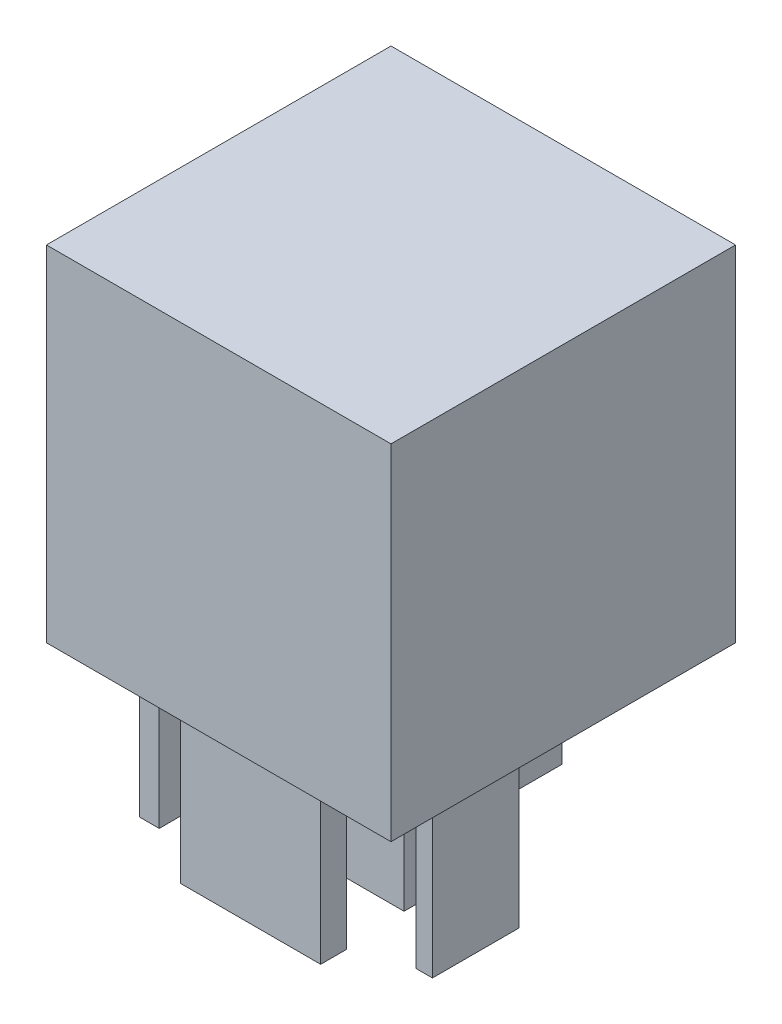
ISO-10303-21;
HEADER;
FILE_DESCRIPTION(('STEP AP214'),'2;1');
FILE_NAME('part.step','',(''),(''),'','','');
FILE_SCHEMA(('AUTOMOTIVE_DESIGN { 1 0 10303 214 1 1 1 1 }'));
ENDSEC;
DATA;
#1=APPLICATION_CONTEXT('core data for automotive mechanical design processes');
#2=APPLICATION_PROTOCOL_DEFINITION('international standard','automotive_design',2000,#1);
#3=PRODUCT_CONTEXT('',#1,'mechanical');
#4=PRODUCT('Part','Part','',(#3));
#5=PRODUCT_RELATED_PRODUCT_CATEGORY('part','',(#4));
#6=PRODUCT_DEFINITION_FORMATION('','',#4);
#7=PRODUCT_DEFINITION_CONTEXT('part definition',#1,'design');
#8=PRODUCT_DEFINITION('design','',#6,#7);
#9=PRODUCT_DEFINITION_SHAPE('','',#8);
#10=(LENGTH_UNIT() NAMED_UNIT(*) SI_UNIT(.MILLI.,.METRE.));
#11=(NAMED_UNIT(*) PLANE_ANGLE_UNIT() SI_UNIT($,.RADIAN.));
#12=(NAMED_UNIT(*) SI_UNIT($,.STERADIAN.) SOLID_ANGLE_UNIT());
#13=UNCERTAINTY_MEASURE_WITH_UNIT(LENGTH_MEASURE(1.E-05),#10,'distance_accuracy_value','');
#14=(GEOMETRIC_REPRESENTATION_CONTEXT(3) GLOBAL_UNCERTAINTY_ASSIGNED_CONTEXT((#13)) GLOBAL_UNIT_ASSIGNED_CONTEXT((#10,
#11,#12)) REPRESENTATION_CONTEXT('',''));
#15=CARTESIAN_POINT('',(0.,0.,0.));
#16=DIRECTION('',(0.,0.,1.));
#17=DIRECTION('',(1.,0.,0.));
#18=AXIS2_PLACEMENT_3D('',#15,#16,#17);
#19=CARTESIAN_POINT('',(-20.,0.,20.));
#20=DIRECTION('',(0.,1.,0.));
#21=DIRECTION('',(0.,0.,1.));
#22=AXIS2_PLACEMENT_3D('',#19,#20,#21);
#23=PLANE('',#22);
#24=DIRECTION('',(0.,0.,-1.));
#25=VECTOR('',#24,1.);
#26=CARTESIAN_POINT('',(14.1829873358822,0.,11.2969143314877));
#27=LINE('',#26,#25);
#28=CARTESIAN_POINT('',(14.1829873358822,0.,11.2969143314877));
#29=VERTEX_POINT('',#28);
#30=CARTESIAN_POINT('',(14.1829873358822,0.,1.23688843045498));
#31=VERTEX_POINT('',#30);
#32=EDGE_CURVE('E214',#29,#31,#27,.T.);
#33=ORIENTED_EDGE('',*,*,#32,.F.);
#34=DIRECTION('',(-1.,0.,0.));
#35=VECTOR('',#34,1.);
#36=CARTESIAN_POINT('',(14.1829873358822,0.,11.2969143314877));
#37=LINE('',#36,#35);
#38=CARTESIAN_POINT('',(16.1070360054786,0.,11.2969143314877));
#39=VERTEX_POINT('',#38);
#40=EDGE_CURVE('E227',#39,#29,#37,.T.);
#41=ORIENTED_EDGE('',*,*,#40,.F.);
#42=DIRECTION('',(0.,0.,1.));
#43=VECTOR('',#42,1.);
#44=CARTESIAN_POINT('',(16.1070360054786,0.,11.2969143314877));
#45=LINE('',#44,#43);
#46=CARTESIAN_POINT('',(16.1070360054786,0.,1.23688843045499));
#47=VERTEX_POINT('',#46);
#48=EDGE_CURVE('E236',#47,#39,#45,.T.);
#49=ORIENTED_EDGE('',*,*,#48,.F.);
#50=DIRECTION('',(1.,0.,0.));
#51=VECTOR('',#50,1.);
#52=CARTESIAN_POINT('',(14.1829873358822,0.,1.23688843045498));
#53=LINE('',#52,#51);
#54=EDGE_CURVE('E217',#31,#47,#53,.T.);
#55=ORIENTED_EDGE('',*,*,#54,.F.);
#56=EDGE_LOOP('',(#33,#41,#49,#55));
#57=FACE_BOUND('',#56,.T.);
#58=DIRECTION('',(0.,0.,-1.));
#59=VECTOR('',#58,1.);
#60=CARTESIAN_POINT('',(-8.24592286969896,0.,6.23941497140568));
#61=LINE('',#60,#59);
#62=CARTESIAN_POINT('',(-8.24592286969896,0.,6.23941497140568));
#63=VERTEX_POINT('',#62);
#64=CARTESIAN_POINT('',(-8.24592286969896,0.,2.61120890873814));
#65=VERTEX_POINT('',#64);
#66=EDGE_CURVE('E285',#63,#65,#61,.T.);
#67=ORIENTED_EDGE('',*,*,#66,.F.);
#68=DIRECTION('',(-1.,0.,0.));
#69=VECTOR('',#68,1.);
#70=CARTESIAN_POINT('',(-8.24592286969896,0.,6.23941497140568));
#71=LINE('',#70,#69);
#72=CARTESIAN_POINT('',(7.75116749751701,0.,6.23941497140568));
#73=VERTEX_POINT('',#72);
#74=EDGE_CURVE('E290',#73,#63,#71,.T.);
#75=ORIENTED_EDGE('',*,*,#74,.F.);
#76=DIRECTION('',(0.,0.,1.));
#77=VECTOR('',#76,1.);
#78=CARTESIAN_POINT('',(7.75116749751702,0.,6.23941497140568));
#79=LINE('',#78,#77);
#80=CARTESIAN_POINT('',(7.75116749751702,0.,2.61120890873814));
#81=VERTEX_POINT('',#80);
#82=EDGE_CURVE('E302',#81,#73,#79,.T.);
#83=ORIENTED_EDGE('',*,*,#82,.F.);
#84=DIRECTION('',(1.,0.,0.));
#85=VECTOR('',#84,1.);
#86=CARTESIAN_POINT('',(-8.24592286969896,0.,2.61120890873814));
#87=LINE('',#86,#85);
#88=EDGE_CURVE('E299',#65,#81,#87,.T.);
#89=ORIENTED_EDGE('',*,*,#88,.F.);
#90=EDGE_LOOP('',(#67,#75,#83,#89));
#91=FACE_BOUND('',#90,.T.);
#92=DIRECTION('',(1.,0.,0.));
#93=VECTOR('',#92,1.);
#94=CARTESIAN_POINT('',(-20.,0.,-20.));
#95=LINE('',#94,#93);
#96=CARTESIAN_POINT('',(-20.,0.,-20.));
#97=VERTEX_POINT('',#96);
#98=CARTESIAN_POINT('',(20.,0.,-20.));
#99=VERTEX_POINT('',#98);
#100=EDGE_CURVE('E365',#97,#99,#95,.T.);
#101=ORIENTED_EDGE('',*,*,#100,.T.);
#102=DIRECTION('',(0.,0.,-1.));
#103=VECTOR('',#102,1.);
#104=CARTESIAN_POINT('',(20.,0.,20.));
#105=LINE('',#104,#103);
#106=CARTESIAN_POINT('',(20.,0.,20.));
#107=VERTEX_POINT('',#106);
#108=EDGE_CURVE('E40',#107,#99,#105,.T.);
#109=ORIENTED_EDGE('',*,*,#108,.F.);
#110=DIRECTION('',(1.,0.,0.));
#111=VECTOR('',#110,1.);
#112=CARTESIAN_POINT('',(-20.,0.,20.));
#113=LINE('',#112,#111);
#114=CARTESIAN_POINT('',(-20.,0.,20.));
#115=VERTEX_POINT('',#114);
#116=EDGE_CURVE('E355',#115,#107,#113,.T.);
#117=ORIENTED_EDGE('',*,*,#116,.F.);
#118=DIRECTION('',(0.,0.,-1.));
#119=VECTOR('',#118,1.);
#120=CARTESIAN_POINT('',(-20.,0.,20.));
#121=LINE('',#120,#119);
#122=EDGE_CURVE('E11',#115,#97,#121,.T.);
#123=ORIENTED_EDGE('',*,*,#122,.T.);
#124=EDGE_LOOP('',(#101,#109,#117,#123));
#125=FACE_BOUND('',#124,.T.);
#126=DIRECTION('',(0.,0.,-1.));
#127=VECTOR('',#126,1.);
#128=CARTESIAN_POINT('',(-8.02603159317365,0.,16.4093865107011));
#129=LINE('',#128,#127);
#130=CARTESIAN_POINT('',(-8.02603159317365,0.,16.4093865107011));
#131=VERTEX_POINT('',#130);
#132=CARTESIAN_POINT('',(-8.02603159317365,0.,13.4408542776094));
#133=VERTEX_POINT('',#132);
#134=EDGE_CURVE('E318',#131,#133,#129,.T.);
#135=ORIENTED_EDGE('',*,*,#134,.F.);
#136=DIRECTION('',(-1.,0.,0.));
#137=VECTOR('',#136,1.);
#138=CARTESIAN_POINT('',(-8.02603159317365,0.,16.4093865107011));
#139=LINE('',#138,#137);
#140=CARTESIAN_POINT('',(8.24592286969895,0.,16.4093865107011));
#141=VERTEX_POINT('',#140);
#142=EDGE_CURVE('E323',#141,#131,#139,.T.);
#143=ORIENTED_EDGE('',*,*,#142,.F.);
#144=DIRECTION('',(0.,0.,1.));
#145=VECTOR('',#144,1.);
#146=CARTESIAN_POINT('',(8.24592286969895,0.,16.4093865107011));
#147=LINE('',#146,#145);
#148=CARTESIAN_POINT('',(8.24592286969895,0.,13.4408542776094));
#149=VERTEX_POINT('',#148);
#150=EDGE_CURVE('E335',#149,#141,#147,.T.);
#151=ORIENTED_EDGE('',*,*,#150,.F.);
#152=DIRECTION('',(1.,0.,0.));
#153=VECTOR('',#152,1.);
#154=CARTESIAN_POINT('',(-8.02603159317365,0.,13.4408542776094));
#155=LINE('',#154,#153);
#156=EDGE_CURVE('E332',#133,#149,#155,.T.);
#157=ORIENTED_EDGE('',*,*,#156,.F.);
#158=EDGE_LOOP('',(#135,#143,#151,#157));
#159=FACE_BOUND('',#158,.T.);
#160=DIRECTION('',(0.,0.,-1.));
#161=VECTOR('',#160,1.);
#162=CARTESIAN_POINT('',(-1.6491845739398,0.,-3.38082837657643));
#163=LINE('',#162,#161);
#164=CARTESIAN_POINT('',(-1.6491845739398,0.,-3.38082837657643));
#165=VERTEX_POINT('',#164);
#166=CARTESIAN_POINT('',(-1.64918457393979,0.,-17.7287341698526));
#167=VERTEX_POINT('',#166);
#168=EDGE_CURVE('E252',#165,#167,#163,.T.);
#169=ORIENTED_EDGE('',*,*,#168,.F.);
#170=DIRECTION('',(-1.,0.,0.));
#171=VECTOR('',#170,1.);
#172=CARTESIAN_POINT('',(-1.6491845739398,0.,-3.38082837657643));
#173=LINE('',#172,#171);
#174=CARTESIAN_POINT('',(2.14393994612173,0.,-3.38082837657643));
#175=VERTEX_POINT('',#174);
#176=EDGE_CURVE('E257',#175,#165,#173,.T.);
#177=ORIENTED_EDGE('',*,*,#176,.F.);
#178=DIRECTION('',(0.,0.,1.));
#179=VECTOR('',#178,1.);
#180=CARTESIAN_POINT('',(2.14393994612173,0.,-3.38082837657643));
#181=LINE('',#180,#179);
#182=CARTESIAN_POINT('',(2.14393994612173,0.,-17.7287341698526));
#183=VERTEX_POINT('',#182);
#184=EDGE_CURVE('E269',#183,#175,#181,.T.);
#185=ORIENTED_EDGE('',*,*,#184,.F.);
#186=DIRECTION('',(1.,0.,0.));
#187=VECTOR('',#186,1.);
#188=CARTESIAN_POINT('',(-1.64918457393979,0.,-17.7287341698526));
#189=LINE('',#188,#187);
#190=EDGE_CURVE('E266',#167,#183,#189,.T.);
#191=ORIENTED_EDGE('',*,*,#190,.F.);
#192=EDGE_LOOP('',(#169,#177,#185,#191));
#193=FACE_BOUND('',#192,.T.);
#194=DIRECTION('',(0.,0.,-1.));
#195=VECTOR('',#194,1.);
#196=CARTESIAN_POINT('',(-17.0965467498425,0.,12.1215066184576));
#197=LINE('',#196,#195);
#198=CARTESIAN_POINT('',(-17.0965467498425,0.,12.1215066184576));
#199=VERTEX_POINT('',#198);
#200=CARTESIAN_POINT('',(-17.0965467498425,0.,0.68716023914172));
#201=VERTEX_POINT('',#200);
#202=EDGE_CURVE('E213',#199,#201,#197,.T.);
#203=ORIENTED_EDGE('',*,*,#202,.F.);
#204=DIRECTION('',(-1.,0.,0.));
#205=VECTOR('',#204,1.);
#206=CARTESIAN_POINT('',(-17.0965467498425,0.,12.1215066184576));
#207=LINE('',#206,#205);
#208=CARTESIAN_POINT('',(-14.7876883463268,0.,12.1215066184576));
#209=VERTEX_POINT('',#208);
#210=EDGE_CURVE('E210',#209,#199,#207,.T.);
#211=ORIENTED_EDGE('',*,*,#210,.F.);
#212=DIRECTION('',(0.,0.,1.));
#213=VECTOR('',#212,1.);
#214=CARTESIAN_POINT('',(-14.7876883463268,0.,12.1215066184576));
#215=LINE('',#214,#213);
#216=CARTESIAN_POINT('',(-14.7876883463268,0.,0.687160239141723));
#217=VERTEX_POINT('',#216);
#218=EDGE_CURVE('E52',#217,#209,#215,.T.);
#219=ORIENTED_EDGE('',*,*,#218,.F.);
#220=DIRECTION('',(1.,0.,0.));
#221=VECTOR('',#220,1.);
#222=CARTESIAN_POINT('',(-17.0965467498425,0.,0.68716023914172));
#223=LINE('',#222,#221);
#224=EDGE_CURVE('E47',#201,#217,#223,.T.);
#225=ORIENTED_EDGE('',*,*,#224,.F.);
#226=EDGE_LOOP('',(#203,#211,#219,#225));
#227=FACE_BOUND('',#226,.T.);
#228=ADVANCED_FACE('F32',(#57,#91,#125,#159,#193,#227),#23,.F.);
#229=CARTESIAN_POINT('',(-20.,0.,20.));
#230=DIRECTION('',(1.,0.,0.));
#231=DIRECTION('',(0.,0.,-1.));
#232=AXIS2_PLACEMENT_3D('',#229,#230,#231);
#233=PLANE('',#232);
#234=DIRECTION('',(0.,-1.,0.));
#235=VECTOR('',#234,1.);
#236=CARTESIAN_POINT('',(-20.,0.,-20.));
#237=LINE('',#236,#235);
#238=CARTESIAN_POINT('',(-20.,40.,-20.));
#239=VERTEX_POINT('',#238);
#240=EDGE_CURVE('E351',#239,#97,#237,.T.);
#241=ORIENTED_EDGE('',*,*,#240,.T.);
#242=ORIENTED_EDGE('',*,*,#122,.F.);
#243=DIRECTION('',(0.,-1.,0.));
#244=VECTOR('',#243,1.);
#245=CARTESIAN_POINT('',(-20.,0.,20.));
#246=LINE('',#245,#244);
#247=CARTESIAN_POINT('',(-20.,40.,20.));
#248=VERTEX_POINT('',#247);
#249=EDGE_CURVE('E352',#248,#115,#246,.T.);
#250=ORIENTED_EDGE('',*,*,#249,.F.);
#251=DIRECTION('',(0.,0.,-1.));
#252=VECTOR('',#251,1.);
#253=CARTESIAN_POINT('',(-20.,40.,20.));
#254=LINE('',#253,#252);
#255=EDGE_CURVE('E362',#248,#239,#254,.T.);
#256=ORIENTED_EDGE('',*,*,#255,.T.);
#257=EDGE_LOOP('',(#241,#242,#250,#256));
#258=FACE_BOUND('',#257,.T.);
#259=ADVANCED_FACE('F34',(#258),#233,.F.);
#260=CARTESIAN_POINT('',(20.,0.,20.));
#261=DIRECTION('',(-1.,0.,0.));
#262=DIRECTION('',(0.,0.,1.));
#263=AXIS2_PLACEMENT_3D('',#260,#261,#262);
#264=PLANE('',#263);
#265=DIRECTION('',(0.,1.,0.));
#266=VECTOR('',#265,1.);
#267=CARTESIAN_POINT('',(20.,0.,-20.));
#268=LINE('',#267,#266);
#269=CARTESIAN_POINT('',(20.,40.,-20.));
#270=VERTEX_POINT('',#269);
#271=EDGE_CURVE('E367',#99,#270,#268,.T.);
#272=ORIENTED_EDGE('',*,*,#271,.T.);
#273=DIRECTION('',(0.,0.,-1.));
#274=VECTOR('',#273,1.);
#275=CARTESIAN_POINT('',(20.,40.,20.));
#276=LINE('',#275,#274);
#277=CARTESIAN_POINT('',(20.,40.,20.));
#278=VERTEX_POINT('',#277);
#279=EDGE_CURVE('E372',#278,#270,#276,.T.);
#280=ORIENTED_EDGE('',*,*,#279,.F.);
#281=DIRECTION('',(0.,1.,0.));
#282=VECTOR('',#281,1.);
#283=CARTESIAN_POINT('',(20.,0.,20.));
#284=LINE('',#283,#282);
#285=EDGE_CURVE('E358',#107,#278,#284,.T.);
#286=ORIENTED_EDGE('',*,*,#285,.F.);
#287=ORIENTED_EDGE('',*,*,#108,.T.);
#288=EDGE_LOOP('',(#272,#280,#286,#287));
#289=FACE_BOUND('',#288,.T.);
#290=ADVANCED_FACE('F379',(#289),#264,.F.);
#291=CARTESIAN_POINT('',(-20.,40.,20.));
#292=DIRECTION('',(0.,-1.,0.));
#293=DIRECTION('',(0.,0.,-1.));
#294=AXIS2_PLACEMENT_3D('',#291,#292,#293);
#295=PLANE('',#294);
#296=DIRECTION('',(-1.,0.,0.));
#297=VECTOR('',#296,1.);
#298=CARTESIAN_POINT('',(-20.,40.,-20.));
#299=LINE('',#298,#297);
#300=EDGE_CURVE('E356',#270,#239,#299,.T.);
#301=ORIENTED_EDGE('',*,*,#300,.T.);
#302=ORIENTED_EDGE('',*,*,#255,.F.);
#303=DIRECTION('',(-1.,0.,0.));
#304=VECTOR('',#303,1.);
#305=CARTESIAN_POINT('',(-20.,40.,20.));
#306=LINE('',#305,#304);
#307=EDGE_CURVE('E360',#278,#248,#306,.T.);
#308=ORIENTED_EDGE('',*,*,#307,.F.);
#309=ORIENTED_EDGE('',*,*,#279,.T.);
#310=EDGE_LOOP('',(#301,#302,#308,#309));
#311=FACE_BOUND('',#310,.T.);
#312=ADVANCED_FACE('F388',(#311),#295,.F.);
#313=CARTESIAN_POINT('',(0.,0.,20.));
#314=DIRECTION('',(0.,0.,-1.));
#315=DIRECTION('',(-1.,0.,0.));
#316=AXIS2_PLACEMENT_3D('',#313,#314,#315);
#317=PLANE('',#316);
#318=ORIENTED_EDGE('',*,*,#249,.T.);
#319=ORIENTED_EDGE('',*,*,#116,.T.);
#320=ORIENTED_EDGE('',*,*,#285,.T.);
#321=ORIENTED_EDGE('',*,*,#307,.T.);
#322=EDGE_LOOP('',(#318,#319,#320,#321));
#323=FACE_BOUND('',#322,.T.);
#324=ADVANCED_FACE('F394',(#323),#317,.F.);
#325=CARTESIAN_POINT('',(0.,0.,-20.));
#326=DIRECTION('',(0.,0.,-1.));
#327=DIRECTION('',(-1.,0.,0.));
#328=AXIS2_PLACEMENT_3D('',#325,#326,#327);
#329=PLANE('',#328);
#330=ORIENTED_EDGE('',*,*,#240,.F.);
#331=ORIENTED_EDGE('',*,*,#300,.F.);
#332=ORIENTED_EDGE('',*,*,#271,.F.);
#333=ORIENTED_EDGE('',*,*,#100,.F.);
#334=EDGE_LOOP('',(#330,#331,#332,#333));
#335=FACE_BOUND('',#334,.T.);
#336=ADVANCED_FACE('F385',(#335),#329,.T.);
#337=CARTESIAN_POINT('',(-8.02603159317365,-20.,16.4093865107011));
#338=DIRECTION('',(1.,0.,0.));
#339=DIRECTION('',(0.,0.,-1.));
#340=AXIS2_PLACEMENT_3D('',#337,#338,#339);
#341=PLANE('',#340);
#342=ORIENTED_EDGE('',*,*,#134,.T.);
#343=DIRECTION('',(0.,1.,0.));
#344=VECTOR('',#343,1.);
#345=CARTESIAN_POINT('',(-8.02603159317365,-20.,13.4408542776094));
#346=LINE('',#345,#344);
#347=CARTESIAN_POINT('',(-8.02603159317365,-20.,13.4408542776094));
#348=VERTEX_POINT('',#347);
#349=EDGE_CURVE('E348',#348,#133,#346,.T.);
#350=ORIENTED_EDGE('',*,*,#349,.F.);
#351=DIRECTION('',(0.,0.,-1.));
#352=VECTOR('',#351,1.);
#353=CARTESIAN_POINT('',(-8.02603159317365,-20.,16.4093865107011));
#354=LINE('',#353,#352);
#355=CARTESIAN_POINT('',(-8.02603159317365,-20.,16.4093865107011));
#356=VERTEX_POINT('',#355);
#357=EDGE_CURVE('E319',#356,#348,#354,.T.);
#358=ORIENTED_EDGE('',*,*,#357,.F.);
#359=DIRECTION('',(0.,1.,0.));
#360=VECTOR('',#359,1.);
#361=CARTESIAN_POINT('',(-8.02603159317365,-20.,16.4093865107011));
#362=LINE('',#361,#360);
#363=EDGE_CURVE('E329',#356,#131,#362,.T.);
#364=ORIENTED_EDGE('',*,*,#363,.T.);
#365=EDGE_LOOP('',(#342,#350,#358,#364));
#366=FACE_BOUND('',#365,.T.);
#367=ADVANCED_FACE('F501',(#366),#341,.F.);
#368=CARTESIAN_POINT('',(-8.02603159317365,-20.,13.4408542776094));
#369=DIRECTION('',(0.,0.,1.));
#370=DIRECTION('',(1.,0.,0.));
#371=AXIS2_PLACEMENT_3D('',#368,#369,#370);
#372=PLANE('',#371);
#373=ORIENTED_EDGE('',*,*,#156,.T.);
#374=DIRECTION('',(0.,1.,0.));
#375=VECTOR('',#374,1.);
#376=CARTESIAN_POINT('',(8.24592286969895,-20.,13.4408542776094));
#377=LINE('',#376,#375);
#378=CARTESIAN_POINT('',(8.24592286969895,-20.,13.4408542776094));
#379=VERTEX_POINT('',#378);
#380=EDGE_CURVE('E345',#379,#149,#377,.T.);
#381=ORIENTED_EDGE('',*,*,#380,.F.);
#382=DIRECTION('',(1.,0.,0.));
#383=VECTOR('',#382,1.);
#384=CARTESIAN_POINT('',(-8.02603159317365,-20.,13.4408542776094));
#385=LINE('',#384,#383);
#386=EDGE_CURVE('E322',#348,#379,#385,.T.);
#387=ORIENTED_EDGE('',*,*,#386,.F.);
#388=ORIENTED_EDGE('',*,*,#349,.T.);
#389=EDGE_LOOP('',(#373,#381,#387,#388));
#390=FACE_BOUND('',#389,.T.);
#391=ADVANCED_FACE('F497',(#390),#372,.F.);
#392=CARTESIAN_POINT('',(8.24592286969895,-20.,16.4093865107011));
#393=DIRECTION('',(-1.,0.,0.));
#394=DIRECTION('',(0.,0.,1.));
#395=AXIS2_PLACEMENT_3D('',#392,#393,#394);
#396=PLANE('',#395);
#397=ORIENTED_EDGE('',*,*,#150,.T.);
#398=DIRECTION('',(0.,1.,0.));
#399=VECTOR('',#398,1.);
#400=CARTESIAN_POINT('',(8.24592286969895,-20.,16.4093865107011));
#401=LINE('',#400,#399);
#402=CARTESIAN_POINT('',(8.24592286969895,-20.,16.4093865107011));
#403=VERTEX_POINT('',#402);
#404=EDGE_CURVE('E342',#403,#141,#401,.T.);
#405=ORIENTED_EDGE('',*,*,#404,.F.);
#406=DIRECTION('',(0.,0.,1.));
#407=VECTOR('',#406,1.);
#408=CARTESIAN_POINT('',(8.24592286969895,-20.,16.4093865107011));
#409=LINE('',#408,#407);
#410=EDGE_CURVE('E325',#379,#403,#409,.T.);
#411=ORIENTED_EDGE('',*,*,#410,.F.);
#412=ORIENTED_EDGE('',*,*,#380,.T.);
#413=EDGE_LOOP('',(#397,#405,#411,#412));
#414=FACE_BOUND('',#413,.T.);
#415=ADVANCED_FACE('F493',(#414),#396,.F.);
#416=CARTESIAN_POINT('',(-8.02603159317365,-20.,16.4093865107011));
#417=DIRECTION('',(0.,0.,-1.));
#418=DIRECTION('',(-1.,0.,0.));
#419=AXIS2_PLACEMENT_3D('',#416,#417,#418);
#420=PLANE('',#419);
#421=ORIENTED_EDGE('',*,*,#142,.T.);
#422=ORIENTED_EDGE('',*,*,#363,.F.);
#423=DIRECTION('',(-1.,0.,0.));
#424=VECTOR('',#423,1.);
#425=CARTESIAN_POINT('',(-8.02603159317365,-20.,16.4093865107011));
#426=LINE('',#425,#424);
#427=EDGE_CURVE('E327',#403,#356,#426,.T.);
#428=ORIENTED_EDGE('',*,*,#427,.F.);
#429=ORIENTED_EDGE('',*,*,#404,.T.);
#430=EDGE_LOOP('',(#421,#422,#428,#429));
#431=FACE_BOUND('',#430,.T.);
#432=ADVANCED_FACE('F489',(#431),#420,.F.);
#433=CARTESIAN_POINT('',(0.,-20.,0.));
#434=DIRECTION('',(0.,-1.,0.));
#435=DIRECTION('',(0.,0.,-1.));
#436=AXIS2_PLACEMENT_3D('',#433,#434,#435);
#437=PLANE('',#436);
#438=ORIENTED_EDGE('',*,*,#357,.T.);
#439=ORIENTED_EDGE('',*,*,#386,.T.);
#440=ORIENTED_EDGE('',*,*,#410,.T.);
#441=ORIENTED_EDGE('',*,*,#427,.T.);
#442=EDGE_LOOP('',(#438,#439,#440,#441));
#443=FACE_BOUND('',#442,.T.);
#444=ADVANCED_FACE('F485',(#443),#437,.T.);
#445=CARTESIAN_POINT('',(-8.24592286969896,-20.,6.23941497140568));
#446=DIRECTION('',(1.,0.,0.));
#447=DIRECTION('',(0.,0.,-1.));
#448=AXIS2_PLACEMENT_3D('',#445,#446,#447);
#449=PLANE('',#448);
#450=ORIENTED_EDGE('',*,*,#66,.T.);
#451=DIRECTION('',(0.,1.,0.));
#452=VECTOR('',#451,1.);
#453=CARTESIAN_POINT('',(-8.24592286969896,-20.,2.61120890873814));
#454=LINE('',#453,#452);
#455=CARTESIAN_POINT('',(-8.24592286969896,-20.,2.61120890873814));
#456=VERTEX_POINT('',#455);
#457=EDGE_CURVE('E315',#456,#65,#454,.T.);
#458=ORIENTED_EDGE('',*,*,#457,.F.);
#459=DIRECTION('',(0.,0.,-1.));
#460=VECTOR('',#459,1.);
#461=CARTESIAN_POINT('',(-8.24592286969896,-20.,6.23941497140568));
#462=LINE('',#461,#460);
#463=CARTESIAN_POINT('',(-8.24592286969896,-20.,6.23941497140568));
#464=VERTEX_POINT('',#463);
#465=EDGE_CURVE('E286',#464,#456,#462,.T.);
#466=ORIENTED_EDGE('',*,*,#465,.F.);
#467=DIRECTION('',(0.,1.,0.));
#468=VECTOR('',#467,1.);
#469=CARTESIAN_POINT('',(-8.24592286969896,-20.,6.23941497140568));
#470=LINE('',#469,#468);
#471=EDGE_CURVE('E296',#464,#63,#470,.T.);
#472=ORIENTED_EDGE('',*,*,#471,.T.);
#473=EDGE_LOOP('',(#450,#458,#466,#472));
#474=FACE_BOUND('',#473,.T.);
#475=ADVANCED_FACE('F481',(#474),#449,.F.);
#476=CARTESIAN_POINT('',(-8.24592286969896,-20.,2.61120890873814));
#477=DIRECTION('',(0.,0.,1.));
#478=DIRECTION('',(1.,0.,0.));
#479=AXIS2_PLACEMENT_3D('',#476,#477,#478);
#480=PLANE('',#479);
#481=ORIENTED_EDGE('',*,*,#88,.T.);
#482=DIRECTION('',(0.,1.,0.));
#483=VECTOR('',#482,1.);
#484=CARTESIAN_POINT('',(7.75116749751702,-20.,2.61120890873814));
#485=LINE('',#484,#483);
#486=CARTESIAN_POINT('',(7.75116749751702,-20.,2.61120890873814));
#487=VERTEX_POINT('',#486);
#488=EDGE_CURVE('E312',#487,#81,#485,.T.);
#489=ORIENTED_EDGE('',*,*,#488,.F.);
#490=DIRECTION('',(1.,0.,0.));
#491=VECTOR('',#490,1.);
#492=CARTESIAN_POINT('',(-8.24592286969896,-20.,2.61120890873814));
#493=LINE('',#492,#491);
#494=EDGE_CURVE('E289',#456,#487,#493,.T.);
#495=ORIENTED_EDGE('',*,*,#494,.F.);
#496=ORIENTED_EDGE('',*,*,#457,.T.);
#497=EDGE_LOOP('',(#481,#489,#495,#496));
#498=FACE_BOUND('',#497,.T.);
#499=ADVANCED_FACE('F477',(#498),#480,.F.);
#500=CARTESIAN_POINT('',(7.75116749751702,-20.,6.23941497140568));
#501=DIRECTION('',(-1.,0.,0.));
#502=DIRECTION('',(0.,0.,1.));
#503=AXIS2_PLACEMENT_3D('',#500,#501,#502);
#504=PLANE('',#503);
#505=ORIENTED_EDGE('',*,*,#82,.T.);
#506=DIRECTION('',(0.,1.,0.));
#507=VECTOR('',#506,1.);
#508=CARTESIAN_POINT('',(7.75116749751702,-20.,6.23941497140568));
#509=LINE('',#508,#507);
#510=CARTESIAN_POINT('',(7.75116749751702,-20.,6.23941497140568));
#511=VERTEX_POINT('',#510);
#512=EDGE_CURVE('E309',#511,#73,#509,.T.);
#513=ORIENTED_EDGE('',*,*,#512,.F.);
#514=DIRECTION('',(0.,0.,1.));
#515=VECTOR('',#514,1.);
#516=CARTESIAN_POINT('',(7.75116749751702,-20.,6.23941497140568));
#517=LINE('',#516,#515);
#518=EDGE_CURVE('E292',#487,#511,#517,.T.);
#519=ORIENTED_EDGE('',*,*,#518,.F.);
#520=ORIENTED_EDGE('',*,*,#488,.T.);
#521=EDGE_LOOP('',(#505,#513,#519,#520));
#522=FACE_BOUND('',#521,.T.);
#523=ADVANCED_FACE('F473',(#522),#504,.F.);
#524=CARTESIAN_POINT('',(-8.24592286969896,-20.,6.23941497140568));
#525=DIRECTION('',(0.,0.,-1.));
#526=DIRECTION('',(-1.,0.,0.));
#527=AXIS2_PLACEMENT_3D('',#524,#525,#526);
#528=PLANE('',#527);
#529=ORIENTED_EDGE('',*,*,#74,.T.);
#530=ORIENTED_EDGE('',*,*,#471,.F.);
#531=DIRECTION('',(-1.,0.,0.));
#532=VECTOR('',#531,1.);
#533=CARTESIAN_POINT('',(-8.24592286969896,-20.,6.23941497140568));
#534=LINE('',#533,#532);
#535=EDGE_CURVE('E294',#511,#464,#534,.T.);
#536=ORIENTED_EDGE('',*,*,#535,.F.);
#537=ORIENTED_EDGE('',*,*,#512,.T.);
#538=EDGE_LOOP('',(#529,#530,#536,#537));
#539=FACE_BOUND('',#538,.T.);
#540=ADVANCED_FACE('F469',(#539),#528,.F.);
#541=CARTESIAN_POINT('',(0.,-20.,0.));
#542=DIRECTION('',(0.,-1.,0.));
#543=DIRECTION('',(0.,0.,-1.));
#544=AXIS2_PLACEMENT_3D('',#541,#542,#543);
#545=PLANE('',#544);
#546=ORIENTED_EDGE('',*,*,#465,.T.);
#547=ORIENTED_EDGE('',*,*,#494,.T.);
#548=ORIENTED_EDGE('',*,*,#518,.T.);
#549=ORIENTED_EDGE('',*,*,#535,.T.);
#550=EDGE_LOOP('',(#546,#547,#548,#549));
#551=FACE_BOUND('',#550,.T.);
#552=ADVANCED_FACE('F465',(#551),#545,.T.);
#553=CARTESIAN_POINT('',(-1.6491845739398,-20.,-3.38082837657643));
#554=DIRECTION('',(1.,0.,0.));
#555=DIRECTION('',(0.,0.,-1.));
#556=AXIS2_PLACEMENT_3D('',#553,#554,#555);
#557=PLANE('',#556);
#558=ORIENTED_EDGE('',*,*,#168,.T.);
#559=DIRECTION('',(0.,1.,0.));
#560=VECTOR('',#559,1.);
#561=CARTESIAN_POINT('',(-1.64918457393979,-20.,-17.7287341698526));
#562=LINE('',#561,#560);
#563=CARTESIAN_POINT('',(-1.64918457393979,-20.,-17.7287341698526));
#564=VERTEX_POINT('',#563);
#565=EDGE_CURVE('E282',#564,#167,#562,.T.);
#566=ORIENTED_EDGE('',*,*,#565,.F.);
#567=DIRECTION('',(0.,0.,-1.));
#568=VECTOR('',#567,1.);
#569=CARTESIAN_POINT('',(-1.6491845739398,-20.,-3.38082837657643));
#570=LINE('',#569,#568);
#571=CARTESIAN_POINT('',(-1.6491845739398,-20.,-3.38082837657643));
#572=VERTEX_POINT('',#571);
#573=EDGE_CURVE('E253',#572,#564,#570,.T.);
#574=ORIENTED_EDGE('',*,*,#573,.F.);
#575=DIRECTION('',(0.,1.,0.));
#576=VECTOR('',#575,1.);
#577=CARTESIAN_POINT('',(-1.6491845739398,-20.,-3.38082837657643));
#578=LINE('',#577,#576);
#579=EDGE_CURVE('E263',#572,#165,#578,.T.);
#580=ORIENTED_EDGE('',*,*,#579,.T.);
#581=EDGE_LOOP('',(#558,#566,#574,#580));
#582=FACE_BOUND('',#581,.T.);
#583=ADVANCED_FACE('F461',(#582),#557,.F.);
#584=CARTESIAN_POINT('',(-1.64918457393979,-20.,-17.7287341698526));
#585=DIRECTION('',(0.,0.,1.));
#586=DIRECTION('',(1.,0.,0.));
#587=AXIS2_PLACEMENT_3D('',#584,#585,#586);
#588=PLANE('',#587);
#589=ORIENTED_EDGE('',*,*,#190,.T.);
#590=DIRECTION('',(0.,1.,0.));
#591=VECTOR('',#590,1.);
#592=CARTESIAN_POINT('',(2.14393994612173,-20.,-17.7287341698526));
#593=LINE('',#592,#591);
#594=CARTESIAN_POINT('',(2.14393994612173,-20.,-17.7287341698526));
#595=VERTEX_POINT('',#594);
#596=EDGE_CURVE('E279',#595,#183,#593,.T.);
#597=ORIENTED_EDGE('',*,*,#596,.F.);
#598=DIRECTION('',(1.,0.,0.));
#599=VECTOR('',#598,1.);
#600=CARTESIAN_POINT('',(-1.64918457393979,-20.,-17.7287341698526));
#601=LINE('',#600,#599);
#602=EDGE_CURVE('E256',#564,#595,#601,.T.);
#603=ORIENTED_EDGE('',*,*,#602,.F.);
#604=ORIENTED_EDGE('',*,*,#565,.T.);
#605=EDGE_LOOP('',(#589,#597,#603,#604));
#606=FACE_BOUND('',#605,.T.);
#607=ADVANCED_FACE('F457',(#606),#588,.F.);
#608=CARTESIAN_POINT('',(2.14393994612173,-20.,-3.38082837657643));
#609=DIRECTION('',(-1.,0.,0.));
#610=DIRECTION('',(0.,0.,1.));
#611=AXIS2_PLACEMENT_3D('',#608,#609,#610);
#612=PLANE('',#611);
#613=ORIENTED_EDGE('',*,*,#184,.T.);
#614=DIRECTION('',(0.,1.,0.));
#615=VECTOR('',#614,1.);
#616=CARTESIAN_POINT('',(2.14393994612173,-20.,-3.38082837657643));
#617=LINE('',#616,#615);
#618=CARTESIAN_POINT('',(2.14393994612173,-20.,-3.38082837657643));
#619=VERTEX_POINT('',#618);
#620=EDGE_CURVE('E276',#619,#175,#617,.T.);
#621=ORIENTED_EDGE('',*,*,#620,.F.);
#622=DIRECTION('',(0.,0.,1.));
#623=VECTOR('',#622,1.);
#624=CARTESIAN_POINT('',(2.14393994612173,-20.,-3.38082837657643));
#625=LINE('',#624,#623);
#626=EDGE_CURVE('E259',#595,#619,#625,.T.);
#627=ORIENTED_EDGE('',*,*,#626,.F.);
#628=ORIENTED_EDGE('',*,*,#596,.T.);
#629=EDGE_LOOP('',(#613,#621,#627,#628));
#630=FACE_BOUND('',#629,.T.);
#631=ADVANCED_FACE('F453',(#630),#612,.F.);
#632=CARTESIAN_POINT('',(-1.6491845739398,-20.,-3.38082837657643));
#633=DIRECTION('',(0.,0.,-1.));
#634=DIRECTION('',(-1.,0.,0.));
#635=AXIS2_PLACEMENT_3D('',#632,#633,#634);
#636=PLANE('',#635);
#637=ORIENTED_EDGE('',*,*,#176,.T.);
#638=ORIENTED_EDGE('',*,*,#579,.F.);
#639=DIRECTION('',(-1.,0.,0.));
#640=VECTOR('',#639,1.);
#641=CARTESIAN_POINT('',(-1.6491845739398,-20.,-3.38082837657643));
#642=LINE('',#641,#640);
#643=EDGE_CURVE('E261',#619,#572,#642,.T.);
#644=ORIENTED_EDGE('',*,*,#643,.F.);
#645=ORIENTED_EDGE('',*,*,#620,.T.);
#646=EDGE_LOOP('',(#637,#638,#644,#645));
#647=FACE_BOUND('',#646,.T.);
#648=ADVANCED_FACE('F449',(#647),#636,.F.);
#649=CARTESIAN_POINT('',(0.,-20.,0.));
#650=DIRECTION('',(0.,-1.,0.));
#651=DIRECTION('',(0.,0.,-1.));
#652=AXIS2_PLACEMENT_3D('',#649,#650,#651);
#653=PLANE('',#652);
#654=ORIENTED_EDGE('',*,*,#573,.T.);
#655=ORIENTED_EDGE('',*,*,#602,.T.);
#656=ORIENTED_EDGE('',*,*,#626,.T.);
#657=ORIENTED_EDGE('',*,*,#643,.T.);
#658=EDGE_LOOP('',(#654,#655,#656,#657));
#659=FACE_BOUND('',#658,.T.);
#660=ADVANCED_FACE('F445',(#659),#653,.T.);
#661=CARTESIAN_POINT('',(14.1829873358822,-20.,11.2969143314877));
#662=DIRECTION('',(1.,0.,0.));
#663=DIRECTION('',(0.,0.,-1.));
#664=AXIS2_PLACEMENT_3D('',#661,#662,#663);
#665=PLANE('',#664);
#666=ORIENTED_EDGE('',*,*,#32,.T.);
#667=DIRECTION('',(0.,1.,0.));
#668=VECTOR('',#667,1.);
#669=CARTESIAN_POINT('',(14.1829873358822,-20.,1.23688843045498));
#670=LINE('',#669,#668);
#671=CARTESIAN_POINT('',(14.1829873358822,-20.,1.23688843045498));
#672=VERTEX_POINT('',#671);
#673=EDGE_CURVE('E249',#672,#31,#670,.T.);
#674=ORIENTED_EDGE('',*,*,#673,.F.);
#675=DIRECTION('',(0.,0.,-1.));
#676=VECTOR('',#675,1.);
#677=CARTESIAN_POINT('',(14.1829873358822,-20.,11.2969143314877));
#678=LINE('',#677,#676);
#679=CARTESIAN_POINT('',(14.1829873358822,-20.,11.2969143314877));
#680=VERTEX_POINT('',#679);
#681=EDGE_CURVE('E223',#680,#672,#678,.T.);
#682=ORIENTED_EDGE('',*,*,#681,.F.);
#683=DIRECTION('',(0.,1.,0.));
#684=VECTOR('',#683,1.);
#685=CARTESIAN_POINT('',(14.1829873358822,-20.,11.2969143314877));
#686=LINE('',#685,#684);
#687=EDGE_CURVE('E232',#680,#29,#686,.T.);
#688=ORIENTED_EDGE('',*,*,#687,.T.);
#689=EDGE_LOOP('',(#666,#674,#682,#688));
#690=FACE_BOUND('',#689,.T.);
#691=ADVANCED_FACE('F441',(#690),#665,.F.);
#692=CARTESIAN_POINT('',(14.1829873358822,-20.,1.23688843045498));
#693=DIRECTION('',(0.,0.,1.));
#694=DIRECTION('',(1.,0.,0.));
#695=AXIS2_PLACEMENT_3D('',#692,#693,#694);
#696=PLANE('',#695);
#697=ORIENTED_EDGE('',*,*,#54,.T.);
#698=DIRECTION('',(0.,1.,0.));
#699=VECTOR('',#698,1.);
#700=CARTESIAN_POINT('',(16.1070360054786,-20.,1.23688843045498));
#701=LINE('',#700,#699);
#702=CARTESIAN_POINT('',(16.1070360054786,-20.,1.23688843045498));
#703=VERTEX_POINT('',#702);
#704=EDGE_CURVE('E246',#703,#47,#701,.T.);
#705=ORIENTED_EDGE('',*,*,#704,.F.);
#706=DIRECTION('',(1.,0.,0.));
#707=VECTOR('',#706,1.);
#708=CARTESIAN_POINT('',(14.1829873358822,-20.,1.23688843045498));
#709=LINE('',#708,#707);
#710=EDGE_CURVE('E226',#672,#703,#709,.T.);
#711=ORIENTED_EDGE('',*,*,#710,.F.);
#712=ORIENTED_EDGE('',*,*,#673,.T.);
#713=EDGE_LOOP('',(#697,#705,#711,#712));
#714=FACE_BOUND('',#713,.T.);
#715=ADVANCED_FACE('F437',(#714),#696,.F.);
#716=CARTESIAN_POINT('',(16.1070360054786,-20.,11.2969143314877));
#717=DIRECTION('',(-1.,0.,0.));
#718=DIRECTION('',(0.,0.,1.));
#719=AXIS2_PLACEMENT_3D('',#716,#717,#718);
#720=PLANE('',#719);
#721=ORIENTED_EDGE('',*,*,#48,.T.);
#722=DIRECTION('',(0.,1.,0.));
#723=VECTOR('',#722,1.);
#724=CARTESIAN_POINT('',(16.1070360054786,-20.,11.2969143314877));
#725=LINE('',#724,#723);
#726=CARTESIAN_POINT('',(16.1070360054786,-20.,11.2969143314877));
#727=VERTEX_POINT('',#726);
#728=EDGE_CURVE('E243',#727,#39,#725,.T.);
#729=ORIENTED_EDGE('',*,*,#728,.F.);
#730=DIRECTION('',(0.,0.,1.));
#731=VECTOR('',#730,1.);
#732=CARTESIAN_POINT('',(16.1070360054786,-20.,11.2969143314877));
#733=LINE('',#732,#731);
#734=EDGE_CURVE('E229',#703,#727,#733,.T.);
#735=ORIENTED_EDGE('',*,*,#734,.F.);
#736=ORIENTED_EDGE('',*,*,#704,.T.);
#737=EDGE_LOOP('',(#721,#729,#735,#736));
#738=FACE_BOUND('',#737,.T.);
#739=ADVANCED_FACE('F433',(#738),#720,.F.);
#740=CARTESIAN_POINT('',(14.1829873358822,-20.,11.2969143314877));
#741=DIRECTION('',(0.,0.,-1.));
#742=DIRECTION('',(-1.,0.,0.));
#743=AXIS2_PLACEMENT_3D('',#740,#741,#742);
#744=PLANE('',#743);
#745=ORIENTED_EDGE('',*,*,#40,.T.);
#746=ORIENTED_EDGE('',*,*,#687,.F.);
#747=DIRECTION('',(-1.,0.,0.));
#748=VECTOR('',#747,1.);
#749=CARTESIAN_POINT('',(14.1829873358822,-20.,11.2969143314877));
#750=LINE('',#749,#748);
#751=EDGE_CURVE('E231',#727,#680,#750,.T.);
#752=ORIENTED_EDGE('',*,*,#751,.F.);
#753=ORIENTED_EDGE('',*,*,#728,.T.);
#754=EDGE_LOOP('',(#745,#746,#752,#753));
#755=FACE_BOUND('',#754,.T.);
#756=ADVANCED_FACE('F429',(#755),#744,.F.);
#757=CARTESIAN_POINT('',(0.,-20.,0.));
#758=DIRECTION('',(0.,-1.,0.));
#759=DIRECTION('',(0.,0.,-1.));
#760=AXIS2_PLACEMENT_3D('',#757,#758,#759);
#761=PLANE('',#760);
#762=ORIENTED_EDGE('',*,*,#681,.T.);
#763=ORIENTED_EDGE('',*,*,#710,.T.);
#764=ORIENTED_EDGE('',*,*,#734,.T.);
#765=ORIENTED_EDGE('',*,*,#751,.T.);
#766=EDGE_LOOP('',(#762,#763,#764,#765));
#767=FACE_BOUND('',#766,.T.);
#768=ADVANCED_FACE('F426',(#767),#761,.T.);
#769=CARTESIAN_POINT('',(-17.0965467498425,-20.,12.1215066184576));
#770=DIRECTION('',(1.,0.,0.));
#771=DIRECTION('',(0.,0.,-1.));
#772=AXIS2_PLACEMENT_3D('',#769,#770,#771);
#773=PLANE('',#772);
#774=ORIENTED_EDGE('',*,*,#202,.T.);
#775=DIRECTION('',(0.,1.,0.));
#776=VECTOR('',#775,1.);
#777=CARTESIAN_POINT('',(-17.0965467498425,-20.,0.68716023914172));
#778=LINE('',#777,#776);
#779=CARTESIAN_POINT('',(-17.0965467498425,-20.,0.68716023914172));
#780=VERTEX_POINT('',#779);
#781=EDGE_CURVE('E194',#780,#201,#778,.T.);
#782=ORIENTED_EDGE('',*,*,#781,.F.);
#783=DIRECTION('',(0.,0.,-1.));
#784=VECTOR('',#783,1.);
#785=CARTESIAN_POINT('',(-17.0965467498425,-20.,12.1215066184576));
#786=LINE('',#785,#784);
#787=CARTESIAN_POINT('',(-17.0965467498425,-20.,12.1215066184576));
#788=VERTEX_POINT('',#787);
#789=EDGE_CURVE('E201',#788,#780,#786,.T.);
#790=ORIENTED_EDGE('',*,*,#789,.F.);
#791=DIRECTION('',(0.,1.,0.));
#792=VECTOR('',#791,1.);
#793=CARTESIAN_POINT('',(-17.0965467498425,-20.,12.1215066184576));
#794=LINE('',#793,#792);
#795=EDGE_CURVE('E404',#788,#199,#794,.T.);
#796=ORIENTED_EDGE('',*,*,#795,.T.);
#797=EDGE_LOOP('',(#774,#782,#790,#796));
#798=FACE_BOUND('',#797,.T.);
#799=ADVANCED_FACE('F212',(#798),#773,.F.);
#800=CARTESIAN_POINT('',(-17.0965467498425,-20.,0.68716023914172));
#801=DIRECTION('',(0.,0.,1.));
#802=DIRECTION('',(1.,0.,0.));
#803=AXIS2_PLACEMENT_3D('',#800,#801,#802);
#804=PLANE('',#803);
#805=ORIENTED_EDGE('',*,*,#224,.T.);
#806=DIRECTION('',(0.,1.,0.));
#807=VECTOR('',#806,1.);
#808=CARTESIAN_POINT('',(-14.7876883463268,-20.,0.68716023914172));
#809=LINE('',#808,#807);
#810=CARTESIAN_POINT('',(-14.7876883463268,-20.,0.68716023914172));
#811=VERTEX_POINT('',#810);
#812=EDGE_CURVE('E197',#811,#217,#809,.T.);
#813=ORIENTED_EDGE('',*,*,#812,.F.);
#814=DIRECTION('',(1.,0.,0.));
#815=VECTOR('',#814,1.);
#816=CARTESIAN_POINT('',(-17.0965467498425,-20.,0.68716023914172));
#817=LINE('',#816,#815);
#818=EDGE_CURVE('E190',#780,#811,#817,.T.);
#819=ORIENTED_EDGE('',*,*,#818,.F.);
#820=ORIENTED_EDGE('',*,*,#781,.T.);
#821=EDGE_LOOP('',(#805,#813,#819,#820));
#822=FACE_BOUND('',#821,.T.);
#823=ADVANCED_FACE('F192',(#822),#804,.F.);
#824=CARTESIAN_POINT('',(-14.7876883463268,-20.,12.1215066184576));
#825=DIRECTION('',(-1.,0.,0.));
#826=DIRECTION('',(0.,0.,1.));
#827=AXIS2_PLACEMENT_3D('',#824,#825,#826);
#828=PLANE('',#827);
#829=ORIENTED_EDGE('',*,*,#218,.T.);
#830=DIRECTION('',(0.,1.,0.));
#831=VECTOR('',#830,1.);
#832=CARTESIAN_POINT('',(-14.7876883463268,-20.,12.1215066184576));
#833=LINE('',#832,#831);
#834=CARTESIAN_POINT('',(-14.7876883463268,-20.,12.1215066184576));
#835=VERTEX_POINT('',#834);
#836=EDGE_CURVE('E219',#835,#209,#833,.T.);
#837=ORIENTED_EDGE('',*,*,#836,.F.);
#838=DIRECTION('',(0.,0.,1.));
#839=VECTOR('',#838,1.);
#840=CARTESIAN_POINT('',(-14.7876883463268,-20.,12.1215066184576));
#841=LINE('',#840,#839);
#842=EDGE_CURVE('E200',#811,#835,#841,.T.);
#843=ORIENTED_EDGE('',*,*,#842,.F.);
#844=ORIENTED_EDGE('',*,*,#812,.T.);
#845=EDGE_LOOP('',(#829,#837,#843,#844));
#846=FACE_BOUND('',#845,.T.);
#847=ADVANCED_FACE('F413',(#846),#828,.F.);
#848=CARTESIAN_POINT('',(-17.0965467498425,-20.,12.1215066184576));
#849=DIRECTION('',(0.,0.,-1.));
#850=DIRECTION('',(-1.,0.,0.));
#851=AXIS2_PLACEMENT_3D('',#848,#849,#850);
#852=PLANE('',#851);
#853=ORIENTED_EDGE('',*,*,#210,.T.);
#854=ORIENTED_EDGE('',*,*,#795,.F.);
#855=DIRECTION('',(-1.,0.,0.));
#856=VECTOR('',#855,1.);
#857=CARTESIAN_POINT('',(-17.0965467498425,-20.,12.1215066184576));
#858=LINE('',#857,#856);
#859=EDGE_CURVE('E206',#835,#788,#858,.T.);
#860=ORIENTED_EDGE('',*,*,#859,.F.);
#861=ORIENTED_EDGE('',*,*,#836,.T.);
#862=EDGE_LOOP('',(#853,#854,#860,#861));
#863=FACE_BOUND('',#862,.T.);
#864=ADVANCED_FACE('F403',(#863),#852,.F.);
#865=CARTESIAN_POINT('',(0.,-20.,0.));
#866=DIRECTION('',(0.,-1.,0.));
#867=DIRECTION('',(0.,0.,-1.));
#868=AXIS2_PLACEMENT_3D('',#865,#866,#867);
#869=PLANE('',#868);
#870=ORIENTED_EDGE('',*,*,#789,.T.);
#871=ORIENTED_EDGE('',*,*,#818,.T.);
#872=ORIENTED_EDGE('',*,*,#842,.T.);
#873=ORIENTED_EDGE('',*,*,#859,.T.);
#874=EDGE_LOOP('',(#870,#871,#872,#873));
#875=FACE_BOUND('',#874,.T.);
#876=ADVANCED_FACE('F204',(#875),#869,.T.);
#877=CLOSED_SHELL('',(#228,#259,#290,#312,#324,#336,#367,#391,#415,#432,#444,#475,#499,#523,
#540,#552,#583,#607,#631,#648,#660,#691,#715,#739,#756,#768,#799,#823,#847,#864,#876));
#878=MANIFOLD_SOLID_BREP('B2',#877);
#879=ADVANCED_BREP_SHAPE_REPRESENTATION('',(#18,#878),#14);
#880=SHAPE_DEFINITION_REPRESENTATION(#9,#879);
ENDSEC;
END-ISO-10303-21;
